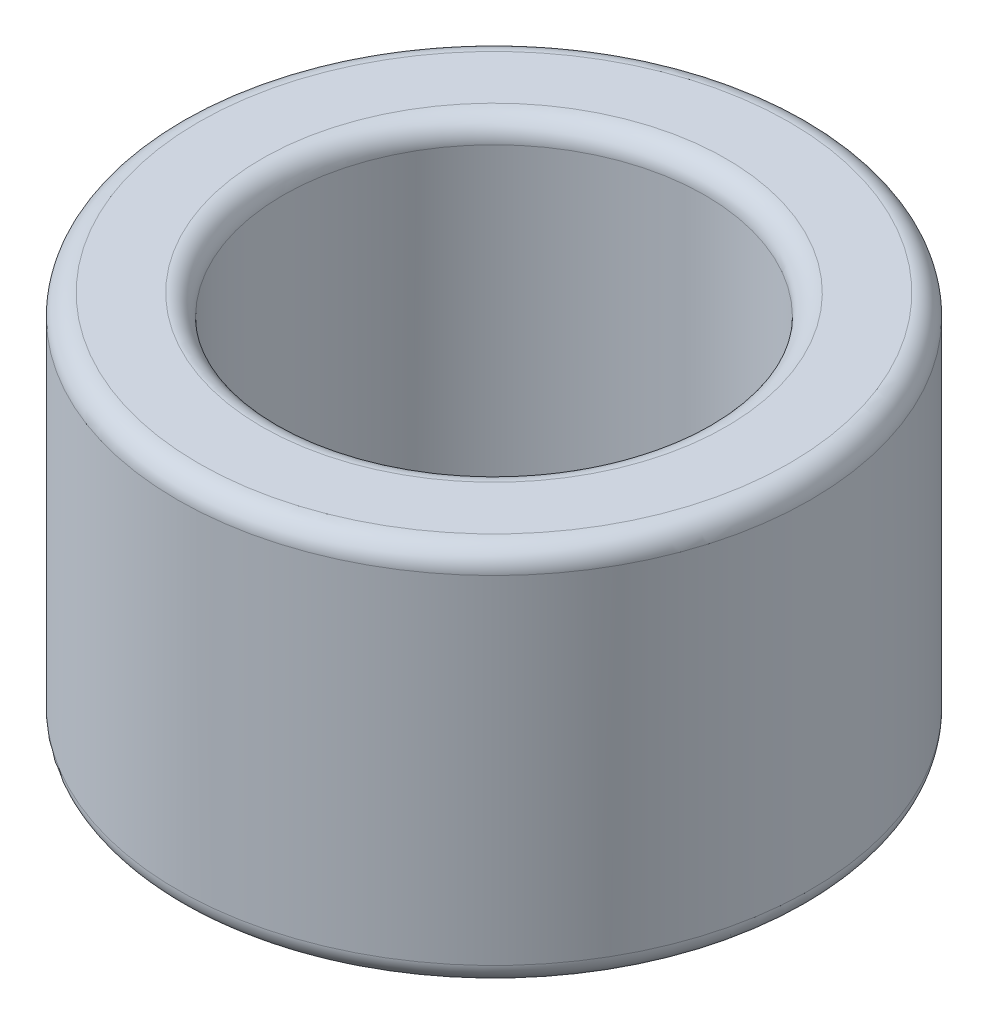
ISO-10303-21;
HEADER;
FILE_DESCRIPTION(('STEP AP214'),'2;1');
FILE_NAME('part.step','',(''),(''),'','','');
FILE_SCHEMA(('AUTOMOTIVE_DESIGN { 1 0 10303 214 1 1 1 1 }'));
ENDSEC;
DATA;
#1=APPLICATION_CONTEXT('core data for automotive mechanical design processes');
#2=APPLICATION_PROTOCOL_DEFINITION('international standard','automotive_design',2000,#1);
#3=PRODUCT_CONTEXT('',#1,'mechanical');
#4=PRODUCT('Part','Part','',(#3));
#5=PRODUCT_RELATED_PRODUCT_CATEGORY('part','',(#4));
#6=PRODUCT_DEFINITION_FORMATION('','',#4);
#7=PRODUCT_DEFINITION_CONTEXT('part definition',#1,'design');
#8=PRODUCT_DEFINITION('design','',#6,#7);
#9=PRODUCT_DEFINITION_SHAPE('','',#8);
#10=(LENGTH_UNIT() NAMED_UNIT(*) SI_UNIT(.MILLI.,.METRE.));
#11=(NAMED_UNIT(*) PLANE_ANGLE_UNIT() SI_UNIT($,.RADIAN.));
#12=(NAMED_UNIT(*) SI_UNIT($,.STERADIAN.) SOLID_ANGLE_UNIT());
#13=UNCERTAINTY_MEASURE_WITH_UNIT(LENGTH_MEASURE(1.E-05),#10,'distance_accuracy_value','');
#14=(GEOMETRIC_REPRESENTATION_CONTEXT(3) GLOBAL_UNCERTAINTY_ASSIGNED_CONTEXT((#13)) GLOBAL_UNIT_ASSIGNED_CONTEXT((#10,
#11,#12)) REPRESENTATION_CONTEXT('',''));
#15=CARTESIAN_POINT('',(0.,0.,0.));
#16=DIRECTION('',(0.,0.,1.));
#17=DIRECTION('',(1.,0.,0.));
#18=AXIS2_PLACEMENT_3D('',#15,#16,#17);
#19=CARTESIAN_POINT('',(0.,0.,0.));
#20=DIRECTION('',(0.,-1.,0.));
#21=DIRECTION('',(0.,0.,-1.));
#22=AXIS2_PLACEMENT_3D('',#19,#20,#21);
#23=CYLINDRICAL_SURFACE('',#22,2.5);
#24=CARTESIAN_POINT('',(0.,0.25,0.));
#25=DIRECTION('',(0.,-1.,0.));
#26=DIRECTION('',(0.,0.,-1.));
#27=AXIS2_PLACEMENT_3D('',#24,#25,#26);
#28=CIRCLE('',#27,2.5);
#29=CARTESIAN_POINT('',(0.,0.25,-2.5));
#30=VERTEX_POINT('',#29);
#31=EDGE_CURVE('E59',#30,#30,#28,.T.);
#32=ORIENTED_EDGE('',*,*,#31,.T.);
#33=EDGE_LOOP('',(#32));
#34=FACE_BOUND('',#33,.T.);
#35=CARTESIAN_POINT('',(0.,4.25,0.));
#36=DIRECTION('',(0.,1.,0.));
#37=DIRECTION('',(0.,0.,1.));
#38=AXIS2_PLACEMENT_3D('',#35,#36,#37);
#39=CIRCLE('',#38,2.5);
#40=CARTESIAN_POINT('',(0.,4.25,2.5));
#41=VERTEX_POINT('',#40);
#42=EDGE_CURVE('E62',#41,#41,#39,.T.);
#43=ORIENTED_EDGE('',*,*,#42,.T.);
#44=EDGE_LOOP('',(#43));
#45=FACE_BOUND('',#44,.T.);
#46=ADVANCED_FACE('F33',(#34,#45),#23,.F.);
#47=CARTESIAN_POINT('',(2.5,4.5,0.));
#48=DIRECTION('',(0.,1.,0.));
#49=DIRECTION('',(0.,0.,1.));
#50=AXIS2_PLACEMENT_3D('',#47,#48,#49);
#51=PLANE('',#50);
#52=CARTESIAN_POINT('',(0.,4.5,0.));
#53=DIRECTION('',(0.,1.,0.));
#54=DIRECTION('',(0.,0.,1.));
#55=AXIS2_PLACEMENT_3D('',#52,#53,#54);
#56=CIRCLE('',#55,3.5);
#57=CARTESIAN_POINT('',(0.,4.5,3.5));
#58=VERTEX_POINT('',#57);
#59=EDGE_CURVE('E10',#58,#58,#56,.T.);
#60=ORIENTED_EDGE('',*,*,#59,.T.);
#61=EDGE_LOOP('',(#60));
#62=FACE_BOUND('',#61,.T.);
#63=CARTESIAN_POINT('',(0.,4.5,0.));
#64=DIRECTION('',(0.,1.,0.));
#65=DIRECTION('',(0.,0.,1.));
#66=AXIS2_PLACEMENT_3D('',#63,#64,#65);
#67=CIRCLE('',#66,2.75);
#68=CARTESIAN_POINT('',(0.,4.5,2.75));
#69=VERTEX_POINT('',#68);
#70=EDGE_CURVE('E40',#69,#69,#67,.F.);
#71=ORIENTED_EDGE('',*,*,#70,.T.);
#72=EDGE_LOOP('',(#71));
#73=FACE_BOUND('',#72,.T.);
#74=ADVANCED_FACE('F76',(#62,#73),#51,.T.);
#75=CARTESIAN_POINT('',(0.,0.,0.));
#76=DIRECTION('',(0.,-1.,0.));
#77=DIRECTION('',(0.,0.,-1.));
#78=AXIS2_PLACEMENT_3D('',#75,#76,#77);
#79=CYLINDRICAL_SURFACE('',#78,3.75);
#80=CARTESIAN_POINT('',(0.,0.25,0.));
#81=DIRECTION('',(0.,-1.,0.));
#82=DIRECTION('',(0.,0.,-1.));
#83=AXIS2_PLACEMENT_3D('',#80,#81,#82);
#84=CIRCLE('',#83,3.75);
#85=CARTESIAN_POINT('',(0.,0.25,-3.75));
#86=VERTEX_POINT('',#85);
#87=EDGE_CURVE('E44',#86,#86,#84,.F.);
#88=ORIENTED_EDGE('',*,*,#87,.T.);
#89=EDGE_LOOP('',(#88));
#90=FACE_BOUND('',#89,.T.);
#91=CARTESIAN_POINT('',(0.,4.25,0.));
#92=DIRECTION('',(0.,1.,0.));
#93=DIRECTION('',(0.,0.,1.));
#94=AXIS2_PLACEMENT_3D('',#91,#92,#93);
#95=CIRCLE('',#94,3.75);
#96=CARTESIAN_POINT('',(0.,4.25,3.75));
#97=VERTEX_POINT('',#96);
#98=EDGE_CURVE('E48',#97,#97,#95,.F.);
#99=ORIENTED_EDGE('',*,*,#98,.T.);
#100=EDGE_LOOP('',(#99));
#101=FACE_BOUND('',#100,.T.);
#102=ADVANCED_FACE('F82',(#90,#101),#79,.T.);
#103=CARTESIAN_POINT('',(2.5,0.,0.));
#104=DIRECTION('',(0.,-1.,0.));
#105=DIRECTION('',(0.,0.,-1.));
#106=AXIS2_PLACEMENT_3D('',#103,#104,#105);
#107=PLANE('',#106);
#108=CARTESIAN_POINT('',(0.,0.,0.));
#109=DIRECTION('',(0.,-1.,0.));
#110=DIRECTION('',(0.,0.,-1.));
#111=AXIS2_PLACEMENT_3D('',#108,#109,#110);
#112=CIRCLE('',#111,2.75);
#113=CARTESIAN_POINT('',(0.,0.,-2.75));
#114=VERTEX_POINT('',#113);
#115=EDGE_CURVE('E53',#114,#114,#112,.F.);
#116=ORIENTED_EDGE('',*,*,#115,.T.);
#117=EDGE_LOOP('',(#116));
#118=FACE_BOUND('',#117,.T.);
#119=CARTESIAN_POINT('',(0.,0.,0.));
#120=DIRECTION('',(0.,-1.,0.));
#121=DIRECTION('',(0.,0.,-1.));
#122=AXIS2_PLACEMENT_3D('',#119,#120,#121);
#123=CIRCLE('',#122,3.5);
#124=CARTESIAN_POINT('',(0.,0.,-3.5));
#125=VERTEX_POINT('',#124);
#126=EDGE_CURVE('E56',#125,#125,#123,.T.);
#127=ORIENTED_EDGE('',*,*,#126,.T.);
#128=EDGE_LOOP('',(#127));
#129=FACE_BOUND('',#128,.T.);
#130=ADVANCED_FACE('F89',(#118,#129),#107,.T.);
#131=CARTESIAN_POINT('',(0.,0.25,0.));
#132=DIRECTION('',(0.,-1.,0.));
#133=DIRECTION('',(0.,0.,-1.));
#134=AXIS2_PLACEMENT_3D('',#131,#132,#133);
#135=TOROIDAL_SURFACE('',#134,2.75,0.25);
#136=ORIENTED_EDGE('',*,*,#115,.F.);
#137=EDGE_LOOP('',(#136));
#138=FACE_BOUND('',#137,.T.);
#139=ORIENTED_EDGE('',*,*,#31,.F.);
#140=EDGE_LOOP('',(#139));
#141=FACE_BOUND('',#140,.T.);
#142=ADVANCED_FACE('F86',(#138,#141),#135,.T.);
#143=CARTESIAN_POINT('',(0.,0.25,0.));
#144=DIRECTION('',(0.,-1.,0.));
#145=DIRECTION('',(0.,0.,-1.));
#146=AXIS2_PLACEMENT_3D('',#143,#144,#145);
#147=TOROIDAL_SURFACE('',#146,3.5,0.25);
#148=ORIENTED_EDGE('',*,*,#87,.F.);
#149=EDGE_LOOP('',(#148));
#150=FACE_BOUND('',#149,.T.);
#151=ORIENTED_EDGE('',*,*,#126,.F.);
#152=EDGE_LOOP('',(#151));
#153=FACE_BOUND('',#152,.T.);
#154=ADVANCED_FACE('F73',(#150,#153),#147,.T.);
#155=CARTESIAN_POINT('',(0.,4.25,0.));
#156=DIRECTION('',(0.,1.,0.));
#157=DIRECTION('',(0.,0.,1.));
#158=AXIS2_PLACEMENT_3D('',#155,#156,#157);
#159=TOROIDAL_SURFACE('',#158,3.5,0.25);
#160=ORIENTED_EDGE('',*,*,#59,.F.);
#161=EDGE_LOOP('',(#160));
#162=FACE_BOUND('',#161,.T.);
#163=ORIENTED_EDGE('',*,*,#98,.F.);
#164=EDGE_LOOP('',(#163));
#165=FACE_BOUND('',#164,.T.);
#166=ADVANCED_FACE('F69',(#162,#165),#159,.T.);
#167=CARTESIAN_POINT('',(0.,4.25,0.));
#168=DIRECTION('',(0.,1.,0.));
#169=DIRECTION('',(0.,0.,1.));
#170=AXIS2_PLACEMENT_3D('',#167,#168,#169);
#171=TOROIDAL_SURFACE('',#170,2.75,0.25);
#172=ORIENTED_EDGE('',*,*,#42,.F.);
#173=EDGE_LOOP('',(#172));
#174=FACE_BOUND('',#173,.T.);
#175=ORIENTED_EDGE('',*,*,#70,.F.);
#176=EDGE_LOOP('',(#175));
#177=FACE_BOUND('',#176,.T.);
#178=ADVANCED_FACE('F35',(#174,#177),#171,.T.);
#179=CLOSED_SHELL('',(#46,#74,#102,#130,#142,#154,#166,#178));
#180=MANIFOLD_SOLID_BREP('B2',#179);
#181=ADVANCED_BREP_SHAPE_REPRESENTATION('',(#18,#180),#14);
#182=SHAPE_DEFINITION_REPRESENTATION(#9,#181);
ENDSEC;
END-ISO-10303-21;
